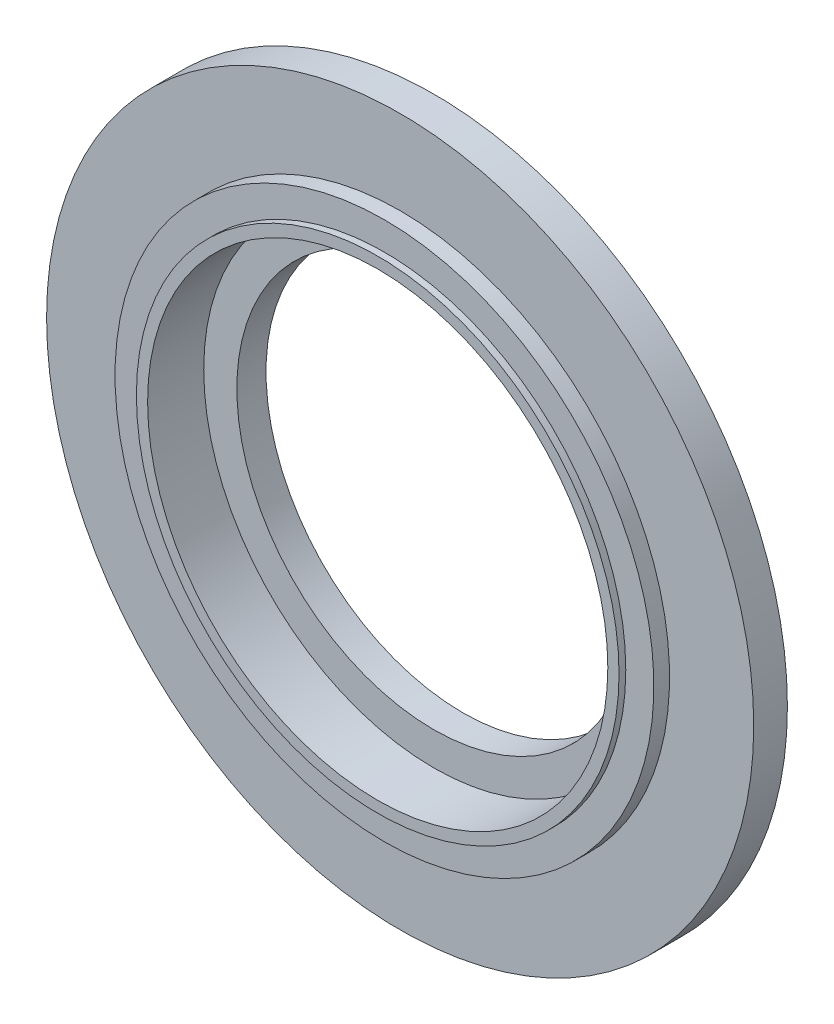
ISO-10303-21;
HEADER;
FILE_DESCRIPTION(('STEP AP214'),'2;1');
FILE_NAME('part.step','',(''),(''),'','','');
FILE_SCHEMA(('AUTOMOTIVE_DESIGN { 1 0 10303 214 1 1 1 1 }'));
ENDSEC;
DATA;
#1=APPLICATION_CONTEXT('core data for automotive mechanical design processes');
#2=APPLICATION_PROTOCOL_DEFINITION('international standard','automotive_design',2000,#1);
#3=PRODUCT_CONTEXT('',#1,'mechanical');
#4=PRODUCT('Part','Part','',(#3));
#5=PRODUCT_RELATED_PRODUCT_CATEGORY('part','',(#4));
#6=PRODUCT_DEFINITION_FORMATION('','',#4);
#7=PRODUCT_DEFINITION_CONTEXT('part definition',#1,'design');
#8=PRODUCT_DEFINITION('design','',#6,#7);
#9=PRODUCT_DEFINITION_SHAPE('','',#8);
#10=(LENGTH_UNIT() NAMED_UNIT(*) SI_UNIT(.MILLI.,.METRE.));
#11=(NAMED_UNIT(*) PLANE_ANGLE_UNIT() SI_UNIT($,.RADIAN.));
#12=(NAMED_UNIT(*) SI_UNIT($,.STERADIAN.) SOLID_ANGLE_UNIT());
#13=UNCERTAINTY_MEASURE_WITH_UNIT(LENGTH_MEASURE(1.E-05),#10,'distance_accuracy_value','');
#14=(GEOMETRIC_REPRESENTATION_CONTEXT(3) GLOBAL_UNCERTAINTY_ASSIGNED_CONTEXT((#13)) GLOBAL_UNIT_ASSIGNED_CONTEXT((#10,
#11,#12)) REPRESENTATION_CONTEXT('',''));
#15=CARTESIAN_POINT('',(0.,0.,0.));
#16=DIRECTION('',(0.,0.,1.));
#17=DIRECTION('',(1.,0.,0.));
#18=AXIS2_PLACEMENT_3D('',#15,#16,#17);
#19=CARTESIAN_POINT('',(115.499995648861,115.499995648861,-13.));
#20=DIRECTION('',(0.,0.,-1.));
#21=DIRECTION('',(0.,-1.,0.));
#22=AXIS2_PLACEMENT_3D('',#19,#20,#21);
#23=PLANE('',#22);
#24=CARTESIAN_POINT('',(0.,-1.04083408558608E-13,-13.));
#25=DIRECTION('',(0.,0.,1.));
#26=DIRECTION('',(1.,0.,0.));
#27=AXIS2_PLACEMENT_3D('',#24,#25,#26);
#28=CIRCLE('',#27,87.75);
#29=CARTESIAN_POINT('',(0.,-87.7500000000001,-13.));
#30=VERTEX_POINT('',#29);
#31=EDGE_CURVE('E9',#30,#30,#28,.T.);
#32=ORIENTED_EDGE('',*,*,#31,.T.);
#33=EDGE_LOOP('',(#32));
#34=FACE_BOUND('',#33,.T.);
#35=CARTESIAN_POINT('',(0.,0.,-13.));
#36=DIRECTION('',(0.,0.,1.));
#37=DIRECTION('',(0.,-1.,0.));
#38=AXIS2_PLACEMENT_3D('',#35,#36,#37);
#39=CIRCLE('',#38,110.);
#40=CARTESIAN_POINT('',(110.,0.,-13.));
#41=VERTEX_POINT('',#40);
#42=EDGE_CURVE('E24',#41,#41,#39,.T.);
#43=ORIENTED_EDGE('',*,*,#42,.F.);
#44=EDGE_LOOP('',(#43));
#45=FACE_BOUND('',#44,.T.);
#46=ADVANCED_FACE('F14',(#34,#45),#23,.T.);
#47=CARTESIAN_POINT('',(0.,0.,0.));
#48=DIRECTION('',(0.,0.,-1.));
#49=DIRECTION('',(-1.,0.,0.));
#50=AXIS2_PLACEMENT_3D('',#47,#48,#49);
#51=CYLINDRICAL_SURFACE('',#50,110.);
#52=CARTESIAN_POINT('',(0.,0.,0.));
#53=DIRECTION('',(0.,0.,1.));
#54=DIRECTION('',(1.,0.,0.));
#55=AXIS2_PLACEMENT_3D('',#52,#53,#54);
#56=CIRCLE('',#55,110.);
#57=CARTESIAN_POINT('',(110.,0.,0.));
#58=VERTEX_POINT('',#57);
#59=EDGE_CURVE('E68',#58,#58,#56,.T.);
#60=ORIENTED_EDGE('',*,*,#59,.F.);
#61=DIRECTION('',(0.,0.,1.));
#62=VECTOR('',#61,1.);
#63=CARTESIAN_POINT('',(110.,0.,-6.5));
#64=LINE('',#63,#62);
#65=EDGE_CURVE('E84',#41,#58,#64,.T.);
#66=ORIENTED_EDGE('',*,*,#65,.F.);
#67=ORIENTED_EDGE('',*,*,#42,.T.);
#68=ORIENTED_EDGE('',*,*,#65,.T.);
#69=EDGE_LOOP('',(#60,#66,#67,#68));
#70=FACE_BOUND('',#69,.T.);
#71=ADVANCED_FACE('F121',(#70),#51,.T.);
#72=CARTESIAN_POINT('',(-165.374994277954,165.374994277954,0.));
#73=DIRECTION('',(0.,0.,-1.));
#74=DIRECTION('',(1.,0.,0.));
#75=AXIS2_PLACEMENT_3D('',#72,#73,#74);
#76=PLANE('',#75);
#77=ORIENTED_EDGE('',*,*,#59,.T.);
#78=EDGE_LOOP('',(#77));
#79=FACE_BOUND('',#78,.T.);
#80=CARTESIAN_POINT('',(0.,0.,0.));
#81=DIRECTION('',(0.,0.,1.));
#82=DIRECTION('',(1.,0.,0.));
#83=AXIS2_PLACEMENT_3D('',#80,#81,#82);
#84=CIRCLE('',#83,157.5);
#85=CARTESIAN_POINT('',(157.5,0.,0.));
#86=VERTEX_POINT('',#85);
#87=EDGE_CURVE('E77',#86,#86,#84,.T.);
#88=ORIENTED_EDGE('',*,*,#87,.F.);
#89=EDGE_LOOP('',(#88));
#90=FACE_BOUND('',#89,.T.);
#91=ADVANCED_FACE('F82',(#79,#90),#76,.T.);
#92=CARTESIAN_POINT('',(0.,0.,0.));
#93=DIRECTION('',(0.,0.,1.));
#94=DIRECTION('',(1.,0.,0.));
#95=AXIS2_PLACEMENT_3D('',#92,#93,#94);
#96=CYLINDRICAL_SURFACE('',#95,157.5);
#97=ORIENTED_EDGE('',*,*,#87,.T.);
#98=DIRECTION('',(0.,0.,-1.));
#99=VECTOR('',#98,1.);
#100=CARTESIAN_POINT('',(157.5,0.,7.5));
#101=LINE('',#100,#99);
#102=CARTESIAN_POINT('',(157.5,0.,15.));
#103=VERTEX_POINT('',#102);
#104=EDGE_CURVE('E74',#103,#86,#101,.T.);
#105=ORIENTED_EDGE('',*,*,#104,.F.);
#106=CARTESIAN_POINT('',(0.,0.,15.));
#107=DIRECTION('',(0.,0.,-1.));
#108=DIRECTION('',(0.,1.,0.));
#109=AXIS2_PLACEMENT_3D('',#106,#107,#108);
#110=CIRCLE('',#109,157.5);
#111=EDGE_CURVE('E78',#103,#103,#110,.T.);
#112=ORIENTED_EDGE('',*,*,#111,.T.);
#113=ORIENTED_EDGE('',*,*,#104,.T.);
#114=EDGE_LOOP('',(#97,#105,#112,#113));
#115=FACE_BOUND('',#114,.T.);
#116=ADVANCED_FACE('F76',(#115),#96,.T.);
#117=CARTESIAN_POINT('',(165.374994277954,-165.374994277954,15.));
#118=DIRECTION('',(0.,0.,1.));
#119=DIRECTION('',(0.,1.,0.));
#120=AXIS2_PLACEMENT_3D('',#117,#118,#119);
#121=PLANE('',#120);
#122=CARTESIAN_POINT('',(-1.16677185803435E-13,1.31838984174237E-13,15.));
#123=DIRECTION('',(0.,0.,-1.));
#124=DIRECTION('',(-1.,0.,0.));
#125=AXIS2_PLACEMENT_3D('',#122,#123,#124);
#126=CIRCLE('',#125,120.);
#127=CARTESIAN_POINT('',(0.,120.,15.));
#128=VERTEX_POINT('',#127);
#129=EDGE_CURVE('E79',#128,#128,#126,.T.);
#130=ORIENTED_EDGE('',*,*,#129,.T.);
#131=EDGE_LOOP('',(#130));
#132=FACE_BOUND('',#131,.T.);
#133=ORIENTED_EDGE('',*,*,#111,.F.);
#134=EDGE_LOOP('',(#133));
#135=FACE_BOUND('',#134,.T.);
#136=ADVANCED_FACE('F135',(#132,#135),#121,.T.);
#137=CARTESIAN_POINT('',(0.,1.56125112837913E-13,15.));
#138=DIRECTION('',(0.,0.,1.));
#139=DIRECTION('',(1.,0.,0.));
#140=AXIS2_PLACEMENT_3D('',#137,#138,#139);
#141=CYLINDRICAL_SURFACE('',#140,120.);
#142=ORIENTED_EDGE('',*,*,#129,.F.);
#143=DIRECTION('',(0.,0.,-1.));
#144=VECTOR('',#143,1.);
#145=CARTESIAN_POINT('',(0.,120.,18.5));
#146=LINE('',#145,#144);
#147=CARTESIAN_POINT('',(0.,120.,22.));
#148=VERTEX_POINT('',#147);
#149=EDGE_CURVE('E94',#148,#128,#146,.T.);
#150=ORIENTED_EDGE('',*,*,#149,.F.);
#151=CARTESIAN_POINT('',(-1.16677185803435E-13,1.31838984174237E-13,22.));
#152=DIRECTION('',(0.,0.,-1.));
#153=DIRECTION('',(-1.,0.,0.));
#154=AXIS2_PLACEMENT_3D('',#151,#152,#153);
#155=CIRCLE('',#154,120.);
#156=EDGE_CURVE('E91',#148,#148,#155,.T.);
#157=ORIENTED_EDGE('',*,*,#156,.T.);
#158=ORIENTED_EDGE('',*,*,#149,.T.);
#159=EDGE_LOOP('',(#142,#150,#157,#158));
#160=FACE_BOUND('',#159,.T.);
#161=ADVANCED_FACE('F138',(#160),#141,.T.);
#162=CARTESIAN_POINT('',(125.999987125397,125.999987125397,22.));
#163=DIRECTION('',(0.,0.,1.));
#164=DIRECTION('',(-1.,0.,0.));
#165=AXIS2_PLACEMENT_3D('',#162,#163,#164);
#166=PLANE('',#165);
#167=CARTESIAN_POINT('',(-2.08166817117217E-13,0.,22.));
#168=DIRECTION('',(0.,0.,-1.));
#169=DIRECTION('',(0.,1.,0.));
#170=AXIS2_PLACEMENT_3D('',#167,#168,#169);
#171=CIRCLE('',#170,107.5);
#172=CARTESIAN_POINT('',(-107.5,1.110223E-13,22.));
#173=VERTEX_POINT('',#172);
#174=EDGE_CURVE('E97',#173,#173,#171,.T.);
#175=ORIENTED_EDGE('',*,*,#174,.T.);
#176=EDGE_LOOP('',(#175));
#177=FACE_BOUND('',#176,.T.);
#178=ORIENTED_EDGE('',*,*,#156,.F.);
#179=EDGE_LOOP('',(#178));
#180=FACE_BOUND('',#179,.T.);
#181=ADVANCED_FACE('F142',(#177,#180),#166,.T.);
#182=CARTESIAN_POINT('',(0.,0.,22.));
#183=DIRECTION('',(0.,0.,1.));
#184=DIRECTION('',(0.,-1.,0.));
#185=AXIS2_PLACEMENT_3D('',#182,#183,#184);
#186=CYLINDRICAL_SURFACE('',#185,107.5);
#187=ORIENTED_EDGE('',*,*,#174,.F.);
#188=DIRECTION('',(0.,0.,-1.));
#189=VECTOR('',#188,1.);
#190=CARTESIAN_POINT('',(-107.5,1.110223E-13,23.5));
#191=LINE('',#190,#189);
#192=CARTESIAN_POINT('',(-107.5,1.110223E-13,25.));
#193=VERTEX_POINT('',#192);
#194=EDGE_CURVE('E103',#193,#173,#191,.T.);
#195=ORIENTED_EDGE('',*,*,#194,.F.);
#196=CARTESIAN_POINT('',(-2.08166817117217E-13,0.,25.));
#197=DIRECTION('',(0.,0.,-1.));
#198=DIRECTION('',(0.,1.,0.));
#199=AXIS2_PLACEMENT_3D('',#196,#197,#198);
#200=CIRCLE('',#199,107.5);
#201=EDGE_CURVE('E100',#193,#193,#200,.T.);
#202=ORIENTED_EDGE('',*,*,#201,.T.);
#203=ORIENTED_EDGE('',*,*,#194,.T.);
#204=EDGE_LOOP('',(#187,#195,#202,#203));
#205=FACE_BOUND('',#204,.T.);
#206=ADVANCED_FACE('F146',(#205),#186,.T.);
#207=CARTESIAN_POINT('',(-112.874999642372,112.874999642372,25.));
#208=DIRECTION('',(0.,0.,1.));
#209=DIRECTION('',(0.,-1.,0.));
#210=AXIS2_PLACEMENT_3D('',#207,#208,#209);
#211=PLANE('',#210);
#212=CARTESIAN_POINT('',(0.,0.,25.));
#213=DIRECTION('',(0.,0.,-1.));
#214=DIRECTION('',(-1.,0.,0.));
#215=AXIS2_PLACEMENT_3D('',#212,#213,#214);
#216=CIRCLE('',#215,102.5);
#217=CARTESIAN_POINT('',(-1.387779E-13,-102.5,25.));
#218=VERTEX_POINT('',#217);
#219=EDGE_CURVE('E106',#218,#218,#216,.T.);
#220=ORIENTED_EDGE('',*,*,#219,.T.);
#221=EDGE_LOOP('',(#220));
#222=FACE_BOUND('',#221,.T.);
#223=ORIENTED_EDGE('',*,*,#201,.F.);
#224=EDGE_LOOP('',(#223));
#225=FACE_BOUND('',#224,.T.);
#226=ADVANCED_FACE('F150',(#222,#225),#211,.T.);
#227=CARTESIAN_POINT('',(0.,0.,25.));
#228=DIRECTION('',(0.,0.,-1.));
#229=DIRECTION('',(-1.,0.,0.));
#230=AXIS2_PLACEMENT_3D('',#227,#228,#229);
#231=CYLINDRICAL_SURFACE('',#230,102.5);
#232=ORIENTED_EDGE('',*,*,#219,.F.);
#233=DIRECTION('',(0.,0.,-1.));
#234=VECTOR('',#233,1.);
#235=CARTESIAN_POINT('',(-1.387779E-13,-102.5,12.5));
#236=LINE('',#235,#234);
#237=CARTESIAN_POINT('',(-1.387779E-13,-102.5,0.));
#238=VERTEX_POINT('',#237);
#239=EDGE_CURVE('E60',#218,#238,#236,.T.);
#240=ORIENTED_EDGE('',*,*,#239,.T.);
#241=CARTESIAN_POINT('',(-1.31838995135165E-13,0.,0.));
#242=DIRECTION('',(0.,0.,1.));
#243=DIRECTION('',(1.,0.,0.));
#244=AXIS2_PLACEMENT_3D('',#241,#242,#243);
#245=CIRCLE('',#244,102.5);
#246=EDGE_CURVE('E62',#238,#238,#245,.T.);
#247=ORIENTED_EDGE('',*,*,#246,.F.);
#248=ORIENTED_EDGE('',*,*,#239,.F.);
#249=EDGE_LOOP('',(#232,#240,#247,#248));
#250=FACE_BOUND('',#249,.T.);
#251=ADVANCED_FACE('F118',(#250),#231,.F.);
#252=CARTESIAN_POINT('',(107.624992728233,107.624992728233,0.));
#253=DIRECTION('',(0.,0.,1.));
#254=DIRECTION('',(-1.,0.,0.));
#255=AXIS2_PLACEMENT_3D('',#252,#253,#254);
#256=PLANE('',#255);
#257=CARTESIAN_POINT('',(0.,0.,0.));
#258=DIRECTION('',(0.,0.,1.));
#259=DIRECTION('',(1.,0.,0.));
#260=AXIS2_PLACEMENT_3D('',#257,#258,#259);
#261=CIRCLE('',#260,87.7500000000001);
#262=CARTESIAN_POINT('',(0.,-87.7500000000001,0.));
#263=VERTEX_POINT('',#262);
#264=EDGE_CURVE('E110',#263,#263,#261,.T.);
#265=ORIENTED_EDGE('',*,*,#264,.F.);
#266=EDGE_LOOP('',(#265));
#267=FACE_BOUND('',#266,.T.);
#268=ORIENTED_EDGE('',*,*,#246,.T.);
#269=EDGE_LOOP('',(#268));
#270=FACE_BOUND('',#269,.T.);
#271=ADVANCED_FACE('F113',(#267,#270),#256,.T.);
#272=CARTESIAN_POINT('',(0.,-1.04083408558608E-13,-13.));
#273=DIRECTION('',(0.,0.,1.));
#274=DIRECTION('',(1.,0.,0.));
#275=AXIS2_PLACEMENT_3D('',#272,#273,#274);
#276=CYLINDRICAL_SURFACE('',#275,87.75);
#277=ORIENTED_EDGE('',*,*,#264,.T.);
#278=DIRECTION('',(0.,0.,1.));
#279=VECTOR('',#278,1.);
#280=CARTESIAN_POINT('',(0.,-87.7500000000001,-6.5));
#281=LINE('',#280,#279);
#282=EDGE_CURVE('E18',#30,#263,#281,.T.);
#283=ORIENTED_EDGE('',*,*,#282,.F.);
#284=ORIENTED_EDGE('',*,*,#31,.F.);
#285=ORIENTED_EDGE('',*,*,#282,.T.);
#286=EDGE_LOOP('',(#277,#283,#284,#285));
#287=FACE_BOUND('',#286,.T.);
#288=ADVANCED_FACE('F16',(#287),#276,.F.);
#289=CLOSED_SHELL('',(#46,#71,#91,#116,#136,#161,#181,#206,#226,#251,#271,#288));
#290=MANIFOLD_SOLID_BREP('B1',#289);
#291=ADVANCED_BREP_SHAPE_REPRESENTATION('',(#18,#290),#14);
#292=SHAPE_DEFINITION_REPRESENTATION(#9,#291);
ENDSEC;
END-ISO-10303-21;
